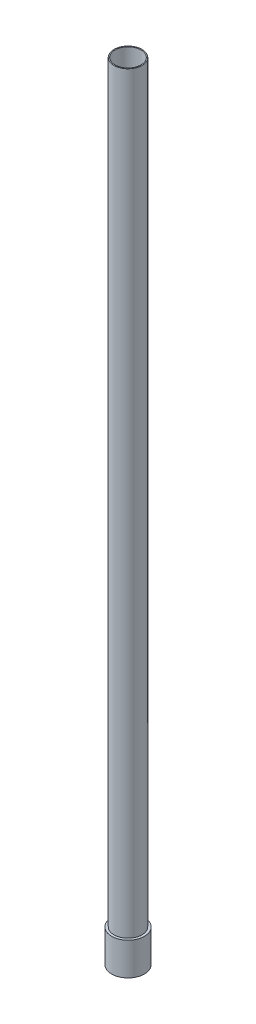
from build123d import *


with BuildPart() as part:
    # Sketch2 → Revolve1 (revolve)
    with BuildSketch(Plane.XY, mode=Mode.PRIVATE) as revolve1_sk:
        Polygon((-5.0419, 0), (-6.35, 0), (-6.35, 12.7), (-5.4229, 12.7), (-5.4229, 304.8), (-5.0419, 304.8), align=None)
    revolve(revolve1_sk.sketch.rotate(Axis((0, 0, 0), (0, 1, 0)), 270), axis=Axis((0, 0, 0), (0, 1, 0)))


solid = part.part
